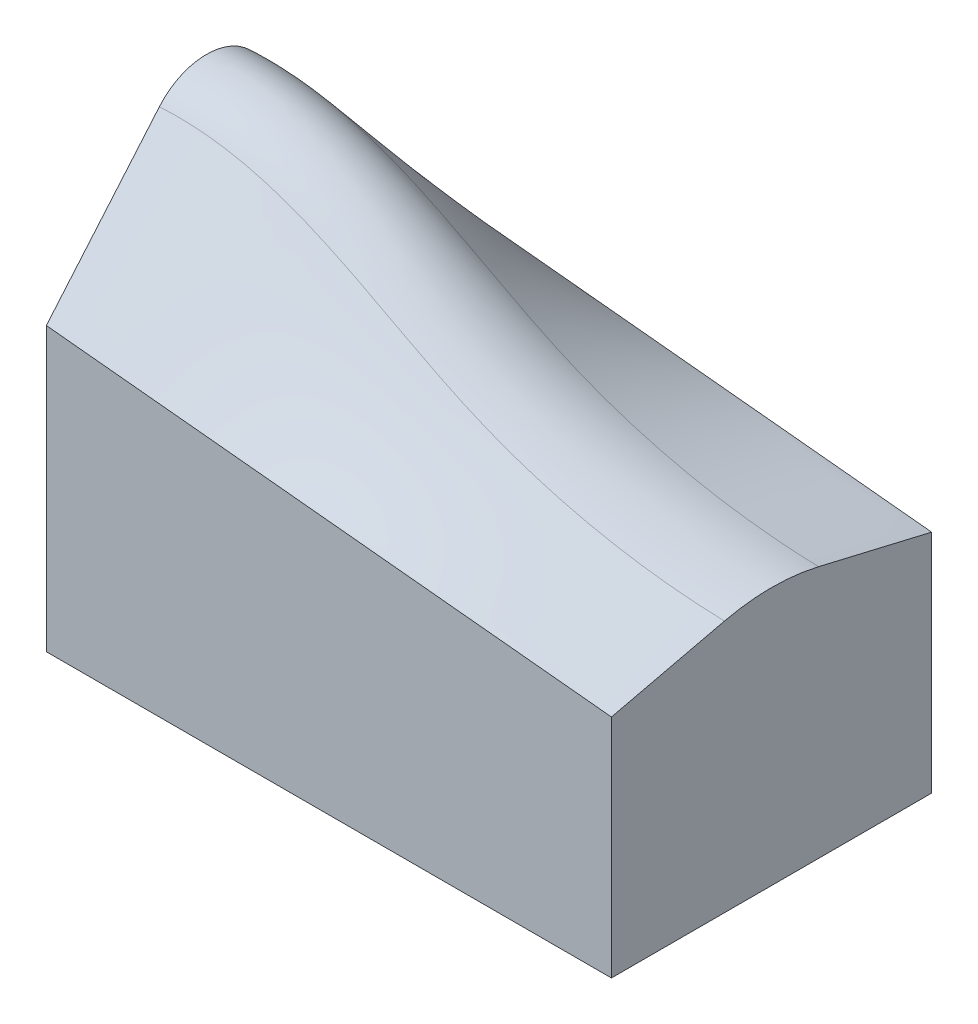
ISO-10303-21;
HEADER;
FILE_DESCRIPTION(('STEP AP214'),'2;1');
FILE_NAME('part.step','',(''),(''),'','','');
FILE_SCHEMA(('AUTOMOTIVE_DESIGN { 1 0 10303 214 1 1 1 1 }'));
ENDSEC;
DATA;
#1=APPLICATION_CONTEXT('core data for automotive mechanical design processes');
#2=APPLICATION_PROTOCOL_DEFINITION('international standard','automotive_design',2000,#1);
#3=PRODUCT_CONTEXT('',#1,'mechanical');
#4=PRODUCT('Part','Part','',(#3));
#5=PRODUCT_RELATED_PRODUCT_CATEGORY('part','',(#4));
#6=PRODUCT_DEFINITION_FORMATION('','',#4);
#7=PRODUCT_DEFINITION_CONTEXT('part definition',#1,'design');
#8=PRODUCT_DEFINITION('design','',#6,#7);
#9=PRODUCT_DEFINITION_SHAPE('','',#8);
#10=(LENGTH_UNIT() NAMED_UNIT(*) SI_UNIT(.MILLI.,.METRE.));
#11=(NAMED_UNIT(*) PLANE_ANGLE_UNIT() SI_UNIT($,.RADIAN.));
#12=(NAMED_UNIT(*) SI_UNIT($,.STERADIAN.) SOLID_ANGLE_UNIT());
#13=UNCERTAINTY_MEASURE_WITH_UNIT(LENGTH_MEASURE(1.E-05),#10,'distance_accuracy_value','');
#14=(GEOMETRIC_REPRESENTATION_CONTEXT(3) GLOBAL_UNCERTAINTY_ASSIGNED_CONTEXT((#13)) GLOBAL_UNIT_ASSIGNED_CONTEXT((#10,
#11,#12)) REPRESENTATION_CONTEXT('',''));
#15=CARTESIAN_POINT('',(0.,0.,0.));
#16=DIRECTION('',(0.,0.,1.));
#17=DIRECTION('',(1.,0.,0.));
#18=AXIS2_PLACEMENT_3D('',#15,#16,#17);
#19=CARTESIAN_POINT('',(3.16358629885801,7.32596468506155,2.50000000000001));
#20=CARTESIAN_POINT('',(2.63634932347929,7.34026394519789,2.50000000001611));
#21=CARTESIAN_POINT('',(2.10909878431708,7.35456357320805,2.50000000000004));
#22=CARTESIAN_POINT('',(1.31820231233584,7.37601357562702,2.50000000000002));
#23=CARTESIAN_POINT('',(1.05456671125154,7.38316366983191,2.50000000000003));
#24=CARTESIAN_POINT('',(0.659108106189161,7.39388895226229,2.50000000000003));
#25=CARTESIAN_POINT('',(0.527287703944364,7.39746406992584,2.50000000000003));
#26=CARTESIAN_POINT('',(0.263645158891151,7.40461435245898,2.50000000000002));
#27=CARTESIAN_POINT('',(0.131823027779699,7.40818947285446,2.50000018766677));
#28=CARTESIAN_POINT('',(-0.164778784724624,7.41623374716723,2.49999976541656));
#29=CARTESIAN_POINT('',(-0.289547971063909,7.42042110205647,2.49999999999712));
#30=CARTESIAN_POINT('',(-0.57800217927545,7.43143505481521,2.50000000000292));
#31=CARTESIAN_POINT('',(-0.72200883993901,7.43772946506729,2.49999999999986));
#32=CARTESIAN_POINT('',(-1.15339398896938,7.45895841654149,2.50000000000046));
#33=CARTESIAN_POINT('',(-1.4401375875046,7.47623749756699,2.49999999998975));
#34=CARTESIAN_POINT('',(-2.29804392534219,7.5373645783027,2.50000000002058));
#35=CARTESIAN_POINT('',(-2.86688276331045,7.59048407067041,2.50000000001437));
#36=CARTESIAN_POINT('',(-4.5658331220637,7.78690213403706,2.49999999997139));
#37=CARTESIAN_POINT('',(-5.68843891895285,7.96695883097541,2.50000000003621));
#38=CARTESIAN_POINT('',(-7.922081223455,8.4321767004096,2.49999999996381));
#39=CARTESIAN_POINT('',(-9.03819871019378,8.7189642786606,2.50000000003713));
#40=CARTESIAN_POINT('',(-11.2378363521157,9.40598581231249,2.49999999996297));
#41=CARTESIAN_POINT('',(-12.3193114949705,9.80496227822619,2.50000000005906));
#42=CARTESIAN_POINT('',(-14.4444547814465,10.7305007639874,2.49999999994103));
#43=CARTESIAN_POINT('',(-15.5453785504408,11.28619009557,2.49999999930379));
#44=CARTESIAN_POINT('',(-17.9244576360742,12.5421425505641,2.50000000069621));
#45=CARTESIAN_POINT('',(-19.1963021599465,13.2411888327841,2.49999999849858));
#46=CARTESIAN_POINT('',(-21.9403008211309,14.5553199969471,2.50000000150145));
#47=CARTESIAN_POINT('',(-23.4083820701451,15.1626577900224,2.49999999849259));
#48=CARTESIAN_POINT('',(-25.7844350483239,15.7704303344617,2.50000000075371));
#49=CARTESIAN_POINT('',(-26.6046193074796,15.9218251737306,2.49999999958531));
#50=CARTESIAN_POINT('',(-27.8687220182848,16.0493421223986,2.50000000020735));
#51=CARTESIAN_POINT('',(-28.295378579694,16.0752174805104,2.50000000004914));
#52=CARTESIAN_POINT('',(-28.9344923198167,16.0881115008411,2.49999999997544));
#53=CARTESIAN_POINT('',(-29.147674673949,16.0881379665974,2.50000000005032));
#54=CARTESIAN_POINT('',(-29.5739723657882,16.0797574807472,2.49999999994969));
#55=CARTESIAN_POINT('',(-29.787087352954,16.0713484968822,2.50000207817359));
#56=CARTESIAN_POINT('',(-30.0851650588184,16.0538135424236,2.49999916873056));
#57=CARTESIAN_POINT('',(-30.1410391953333,16.0505250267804,2.5));
#58=CARTESIAN_POINT('',(-30.2719385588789,16.0428231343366,2.49999999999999));
#59=CARTESIAN_POINT('',(-30.3373886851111,16.0389721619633,2.50000000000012));
#60=CARTESIAN_POINT('',(-30.5337404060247,16.0274191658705,2.49999999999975));
#61=CARTESIAN_POINT('',(-30.6646433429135,16.019717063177,2.49999999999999));
#62=CARTESIAN_POINT('',(-31.057357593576,15.9966104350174,2.5));
#63=CARTESIAN_POINT('',(-31.3191743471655,15.9812055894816,2.50000000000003));
#64=CARTESIAN_POINT('',(-32.104646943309,15.9349897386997,2.49999999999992));
#65=CARTESIAN_POINT('',(-32.6283251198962,15.904177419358,2.49999999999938));
#66=CARTESIAN_POINT('',(-33.1520346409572,15.8733632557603,2.5));
#67=CARTESIAN_POINT('',(3.18200019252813,8.00491489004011,0.));
#68=CARTESIAN_POINT('',(2.65516144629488,8.00402509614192,1.62099153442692E-12));
#69=CARTESIAN_POINT('',(2.12745369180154,8.00313383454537,-4.90650107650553E-12));
#70=CARTESIAN_POINT('',(1.33536506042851,8.00179605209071,2.45540287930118E-12));
#71=CARTESIAN_POINT('',(1.0715176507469,8.00135043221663,-1.130512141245E-13));
#72=CARTESIAN_POINT('',(0.675611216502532,8.00068177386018,0.));
#73=CARTESIAN_POINT('',(0.543687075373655,8.00045896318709,-5.76179924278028E-13));
#74=CARTESIAN_POINT('',(0.279838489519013,8.00001334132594,6.49916871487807E-13));
#75=CARTESIAN_POINT('',(0.14692625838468,7.99984294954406,-6.53441255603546E-13));
#76=CARTESIAN_POINT('',(-0.147663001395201,7.99922376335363,8.22027194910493E-13));
#77=CARTESIAN_POINT('',(-0.269493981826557,7.99992777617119,-9.92497481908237E-13));
#78=CARTESIAN_POINT('',(-0.553994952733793,8.00351409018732,1.03652081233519E-12));
#79=CARTESIAN_POINT('',(-0.696065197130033,8.00637822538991,-2.86546664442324E-12));
#80=CARTESIAN_POINT('',(-1.1215707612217,8.01815703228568,5.87465694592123E-12));
#81=CARTESIAN_POINT('',(-1.40461502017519,8.03025992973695,5.2402836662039E-12));
#82=CARTESIAN_POINT('',(-2.25099341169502,8.07914720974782,-1.03834145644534E-11));
#83=CARTESIAN_POINT('',(-2.8127766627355,8.12854386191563,-6.76389649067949E-12));
#84=CARTESIAN_POINT('',(-4.48765194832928,8.3265214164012,1.37909470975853E-11));
#85=CARTESIAN_POINT('',(-5.59533994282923,8.52555028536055,-4.02918768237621E-12));
#86=CARTESIAN_POINT('',(-7.77632068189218,9.05984099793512,4.17393113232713E-12));
#87=CARTESIAN_POINT('',(-8.86347040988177,9.40070821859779,-3.34946602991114E-12));
#88=CARTESIAN_POINT('',(-10.9660522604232,10.220830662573,3.47593008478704E-12));
#89=CARTESIAN_POINT('',(-11.9919729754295,10.7070031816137,-1.56771809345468E-11));
#90=CARTESIAN_POINT('',(-13.9473990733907,11.817960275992,1.63346640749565E-11));
#91=CARTESIAN_POINT('',(-14.9644618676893,12.5142394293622,-3.66992430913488E-12));
#92=CARTESIAN_POINT('',(-17.1366937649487,14.108921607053,3.99698022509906E-12));
#93=CARTESIAN_POINT('',(-18.324189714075,15.0395215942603,4.605241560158E-12));
#94=CARTESIAN_POINT('',(-21.0145718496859,16.8768496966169,-5.02673958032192E-12));
#95=CARTESIAN_POINT('',(-22.5281734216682,17.7624865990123,1.09952462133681E-12));
#96=CARTESIAN_POINT('',(-25.1927855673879,18.6701338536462,-5.5977800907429E-13));
#97=CARTESIAN_POINT('',(-26.1459666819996,18.8919995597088,3.83636727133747E-12));
#98=CARTESIAN_POINT('',(-27.6461920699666,19.0576701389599,-1.90468925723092E-12));
#99=CARTESIAN_POINT('',(-28.1532673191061,19.0841273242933,0.));
#100=CARTESIAN_POINT('',(-28.9138717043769,19.0802212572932,0.));
#101=CARTESIAN_POINT('',(-29.1666347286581,19.0717672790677,7.52830725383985E-13));
#102=CARTESIAN_POINT('',(-29.6708431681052,19.0409856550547,-7.34161546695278E-13));
#103=CARTESIAN_POINT('',(-29.9408267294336,19.016498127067,2.47052000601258E-13));
#104=CARTESIAN_POINT('',(-30.2647769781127,18.9792330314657,-1.00286589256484E-13));
#105=CARTESIAN_POINT('',(-30.3129876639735,18.9737207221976,1.77212893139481E-13));
#106=CARTESIAN_POINT('',(-30.443459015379,18.9587432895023,-1.90825716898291E-13));
#107=CARTESIAN_POINT('',(-30.5086950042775,18.9512545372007,2.52811213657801E-13));
#108=CARTESIAN_POINT('',(-30.7042639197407,18.9288042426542,-5.11027163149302E-13));
#109=CARTESIAN_POINT('',(-30.8347380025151,18.9138264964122,0.));
#110=CARTESIAN_POINT('',(-31.2256058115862,18.8689569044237,1.66773434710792E-13));
#111=CARTESIAN_POINT('',(-31.4865603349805,18.8390006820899,2.27576347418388E-13));
#112=CARTESIAN_POINT('',(-32.2672204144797,18.7493849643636,-4.49934374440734E-13));
#113=CARTESIAN_POINT('',(-32.7891394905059,18.6894713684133,-7.74812151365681E-12));
#114=CARTESIAN_POINT('',(-33.3141832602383,18.6291990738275,0.));
#115=CARTESIAN_POINT('',(3.163586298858,7.32596468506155,-2.49999999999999));
#116=CARTESIAN_POINT('',(2.6363493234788,7.3402639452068,-2.49999999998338));
#117=CARTESIAN_POINT('',(2.10909878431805,7.35456357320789,-2.50000000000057));
#118=CARTESIAN_POINT('',(1.31820231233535,7.37601357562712,-2.49999999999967));
#119=CARTESIAN_POINT('',(1.05456671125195,7.38316366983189,-2.50000000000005));
#120=CARTESIAN_POINT('',(0.659108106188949,7.39388895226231,-2.49999999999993));
#121=CARTESIAN_POINT('',(0.527287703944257,7.3974640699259,-2.49999999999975));
#122=CARTESIAN_POINT('',(0.263645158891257,7.40461435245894,-2.50000000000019));
#123=CARTESIAN_POINT('',(0.131823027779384,7.40818947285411,-2.50000018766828));
#124=CARTESIAN_POINT('',(-0.164778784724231,7.41623374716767,-2.49999976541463));
#125=CARTESIAN_POINT('',(-0.28954797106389,7.42042110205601,-2.49999999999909));
#126=CARTESIAN_POINT('',(-0.578002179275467,7.43143505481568,-2.50000000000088));
#127=CARTESIAN_POINT('',(-0.722008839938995,7.43772946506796,-2.49999999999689));
#128=CARTESIAN_POINT('',(-1.1533939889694,7.45895841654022,-2.50000000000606));
#129=CARTESIAN_POINT('',(-1.44013758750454,7.47623749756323,-2.50000000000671));
#130=CARTESIAN_POINT('',(-2.29804392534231,7.53736457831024,-2.49999999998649));
#131=CARTESIAN_POINT('',(-2.86688276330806,7.59048407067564,-2.49999999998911));
#132=CARTESIAN_POINT('',(-4.56583312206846,7.78690213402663,-2.50000000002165));
#133=CARTESIAN_POINT('',(-5.68843891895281,7.96695883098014,-2.50000000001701));
#134=CARTESIAN_POINT('',(-7.92208122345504,8.43217670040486,-2.49999999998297));
#135=CARTESIAN_POINT('',(-9.03819871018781,8.71896427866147,-2.50000000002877));
#136=CARTESIAN_POINT('',(-11.2378363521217,9.40598581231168,-2.49999999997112));
#137=CARTESIAN_POINT('',(-12.3193114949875,9.8049622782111,-2.500000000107));
#138=CARTESIAN_POINT('',(-14.4444547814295,10.7305007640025,-2.49999999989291));
#139=CARTESIAN_POINT('',(-15.5453785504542,11.2861900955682,-2.49999999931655));
#140=CARTESIAN_POINT('',(-17.9244576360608,12.542142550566,-2.50000000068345));
#141=CARTESIAN_POINT('',(-19.1963021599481,13.2411888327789,-2.49999999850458));
#142=CARTESIAN_POINT('',(-21.9403008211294,14.5553199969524,-2.50000000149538));
#143=CARTESIAN_POINT('',(-23.4083820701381,15.1626577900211,-2.49999999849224));
#144=CARTESIAN_POINT('',(-25.7844350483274,15.7704303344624,-2.50000000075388));
#145=CARTESIAN_POINT('',(-26.604619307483,15.9218251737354,-2.49999999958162));
#146=CARTESIAN_POINT('',(-27.8687220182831,16.0493421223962,-2.50000000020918));
#147=CARTESIAN_POINT('',(-28.2953785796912,16.0752174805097,-2.50000000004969));
#148=CARTESIAN_POINT('',(-28.9344923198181,16.0881115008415,-2.49999999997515));
#149=CARTESIAN_POINT('',(-29.1476746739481,16.0881379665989,-2.50000000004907));
#150=CARTESIAN_POINT('',(-29.5739723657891,16.0797574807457,-2.49999999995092));
#151=CARTESIAN_POINT('',(-29.787087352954,16.0713484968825,-2.5000020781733));
#152=CARTESIAN_POINT('',(-30.0851650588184,16.0538135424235,-2.49999916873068));
#153=CARTESIAN_POINT('',(-30.1410391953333,16.0505250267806,-2.49999999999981));
#154=CARTESIAN_POINT('',(-30.2719385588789,16.0428231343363,-2.5000000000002));
#155=CARTESIAN_POINT('',(-30.3373886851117,16.0389721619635,-2.49999999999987));
#156=CARTESIAN_POINT('',(-30.5337404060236,16.02741916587,-2.50000000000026));
#157=CARTESIAN_POINT('',(-30.6646433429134,16.019717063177,-2.5));
#158=CARTESIAN_POINT('',(-31.057357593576,15.9966104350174,-2.50000000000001));
#159=CARTESIAN_POINT('',(-31.3191743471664,15.9812055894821,-2.49999999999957));
#160=CARTESIAN_POINT('',(-32.1046469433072,15.9349897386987,-2.50000000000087));
#161=CARTESIAN_POINT('',(-32.6283251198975,15.9041774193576,-2.49999999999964));
#162=CARTESIAN_POINT('',(-33.1520346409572,15.8733632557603,-2.5));
#163=(BOUNDED_SURFACE() B_SPLINE_SURFACE(2,3,((#19,#20,#21,#22,#23,#24,#25,#26,#27,#28,#29,#30,
#31,#32,#33,#34,#35,#36,#37,#38,#39,#40,#41,#42,#43,#44,#45,#46,#47,#48,#49,#50,#51,#52,#53,#54,
#55,#56,#57,#58,#59,#60,#61,#62,#63,#64,#65,#66),(#67,#68,#69,#70,#71,#72,#73,#74,#75,#76,#77,
#78,#79,#80,#81,#82,#83,#84,#85,#86,#87,#88,#89,#90,#91,#92,#93,#94,#95,#96,#97,#98,#99,#100,
#101,#102,#103,#104,#105,#106,#107,#108,#109,#110,#111,#112,#113,#114),(#115,#116,#117,#118,
#119,#120,#121,#122,#123,#124,#125,#126,#127,#128,#129,#130,#131,#132,#133,#134,#135,#136,#137,
#138,#139,#140,#141,#142,#143,#144,#145,#146,#147,#148,#149,#150,#151,#152,#153,#154,#155,#156,
#157,#158,#159,#160,#161,#162)),.UNSPECIFIED.,.F.,.F.,.F.) B_SPLINE_SURFACE_WITH_KNOTS((3,3),(4,
2,2,2,2,2,2,2,2,2,2,2,2,2,2,2,2,2,2,2,2,2,2,4),(0.,1.),(0.00714343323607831,0.00872139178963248,
0.00951037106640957,0.00990486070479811,0.0102993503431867,0.0107924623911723,0.011285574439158,
0.0122717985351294,0.0142442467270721,0.0181891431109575,0.0221340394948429,0.0260789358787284,
0.0300238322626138,0.0339687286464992,0.0379136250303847,0.0398860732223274,0.0408722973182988,
0.0413654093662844,0.0418585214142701,0.0420557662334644,0.0422530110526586,0.0426475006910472,
0.0434364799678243,0.0450144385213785),
.UNSPECIFIED.) GEOMETRIC_REPRESENTATION_ITEM() RATIONAL_B_SPLINE_SURFACE(((1.,1.,1.,1.,1.,1.,1.,
1.,1.,1.,1.,1.,1.,1.,1.,1.,1.,1.,1.,1.,1.,1.,1.,1.,1.,1.,1.,1.,1.,1.,1.,1.,1.,1.,1.,1.,1.,1.,1.,
1.,1.,1.,1.,1.,1.,1.,1.,1.),(0.965019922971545,0.96650399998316,0.967948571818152,
0.970053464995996,0.970744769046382,0.971765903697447,0.972103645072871,0.972773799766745,
0.973103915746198,0.973850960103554,0.974141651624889,0.974761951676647,0.975044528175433,
0.975813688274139,0.976221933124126,0.977157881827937,0.97740034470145,0.977051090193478,
0.975436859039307,0.968473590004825,0.963069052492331,0.946133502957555,0.934574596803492,
0.902884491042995,0.880279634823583,0.820057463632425,0.782255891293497,0.709071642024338,
0.674653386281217,0.645825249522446,0.64003282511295,0.6382399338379,0.638781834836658,
0.641203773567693,0.642277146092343,0.644923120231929,0.64663836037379,0.648961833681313,
0.649303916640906,0.650239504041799,0.650707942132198,0.652115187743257,0.653055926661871,
0.655885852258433,0.65778274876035,0.66350410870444,0.667359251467,0.671254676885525),(1.,1.,1.,
1.,1.,1.,1.,1.,1.,1.,1.,1.,1.,1.,1.,1.,1.,1.,1.,1.,1.,1.,1.,1.,1.,1.,1.,1.,1.,1.,1.,1.,1.,1.,1.,
1.,1.,1.,1.,1.,1.,1.,1.,1.,1.,1.,1.,1.))) REPRESENTATION_ITEM('') SURFACE());
#164=CARTESIAN_POINT('',(0.,7.41176470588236,2.50000000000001));
#165=CARTESIAN_POINT('',(-4.5771550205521,7.53590230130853,2.50000000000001));
#166=CARTESIAN_POINT('',(-15.3083363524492,9.67056029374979,2.50000000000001));
#167=CARTESIAN_POINT('',(-23.2907730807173,16.4535828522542,2.50000000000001));
#168=CARTESIAN_POINT('',(-30.,16.0588235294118,2.50000000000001));
#169=B_SPLINE_CURVE_WITH_KNOTS('',3,(#164,#165,#166,#167,#168),.UNSPECIFIED.,.F.,.F.,(4,1,4),
(0.,0.43459880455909,1.),.UNSPECIFIED.);
#170=CARTESIAN_POINT('',(0.,7.41176470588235,2.50000000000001));
#171=VERTEX_POINT('',#170);
#172=CARTESIAN_POINT('',(-30.,16.0588235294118,2.5));
#173=VERTEX_POINT('',#172);
#174=EDGE_CURVE('E342',#171,#173,#169,.T.);
#175=CARTESIAN_POINT('',(0.,7.41176470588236,-2.49999999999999));
#176=CARTESIAN_POINT('',(-9.1337761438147E-13,7.47403317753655,-2.2354375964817));
#177=CARTESIAN_POINT('',(-5.65686585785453E-13,7.52636948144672,-1.96854600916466));
#178=CARTESIAN_POINT('',(5.65668704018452E-13,7.6109888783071,-1.4316106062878));
#179=CARTESIAN_POINT('',(1.34931918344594E-12,7.64327260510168,-1.1615668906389));
#180=CARTESIAN_POINT('',(1.26523274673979E-12,7.68835391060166,-0.610626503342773));
#181=CARTESIAN_POINT('',(3.40567396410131E-13,7.70045322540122,-0.329672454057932));
#182=CARTESIAN_POINT('',(-3.40577192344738E-13,7.70295795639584,0.232337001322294));
#183=CARTESIAN_POINT('',(0.,7.6933627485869,0.513392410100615));
#184=CARTESIAN_POINT('',(1.02463174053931E-13,7.6520131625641,1.08088725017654));
#185=CARTESIAN_POINT('',(0.,7.61971477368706,1.36728720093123));
#186=CARTESIAN_POINT('',(0.,7.53258687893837,1.93666610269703));
#187=CARTESIAN_POINT('',(-1.01974186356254E-13,7.47775524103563,2.21964472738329));
#188=CARTESIAN_POINT('',(0.,7.41176470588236,2.50000000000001));
#189=B_SPLINE_CURVE_WITH_KNOTS('',3,(#175,#176,#177,#178,#179,#180,#181,#182,#183,#184,#185,
#186,#187,#188),.UNSPECIFIED.,.F.,.F.,(4,2,2,2,2,2,4),(0.,0.815171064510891,1.63031636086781,
2.47311699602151,3.31594187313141,4.1796829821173,5.04350583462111),.UNSPECIFIED.);
#190=CARTESIAN_POINT('',(0.,7.41176470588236,-2.49999999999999));
#191=VERTEX_POINT('',#190);
#192=EDGE_CURVE('E121',#191,#171,#189,.T.);
#193=CARTESIAN_POINT('',(-30.,16.0588235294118,-2.5));
#194=CARTESIAN_POINT('',(-23.2907730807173,16.4535828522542,-2.5));
#195=CARTESIAN_POINT('',(-15.3083363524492,9.67056029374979,-2.5));
#196=CARTESIAN_POINT('',(-4.57715502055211,7.53590230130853,-2.5));
#197=CARTESIAN_POINT('',(0.,7.41176470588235,-2.5));
#198=B_SPLINE_CURVE_WITH_KNOTS('',3,(#193,#194,#195,#196,#197),.UNSPECIFIED.,.F.,.F.,(4,1,4),
(0.,0.56540119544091,1.),.UNSPECIFIED.);
#199=CARTESIAN_POINT('',(-30.,16.0588235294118,-2.5));
#200=VERTEX_POINT('',#199);
#201=EDGE_CURVE('E353',#200,#191,#198,.T.);
#202=CARTESIAN_POINT('',(-30.,16.0588235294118,2.5));
#203=CARTESIAN_POINT('',(-30.,16.1292522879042,2.44014721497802));
#204=CARTESIAN_POINT('',(-30.,16.1971496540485,2.37732158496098));
#205=CARTESIAN_POINT('',(-30.,16.327425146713,2.24619059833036));
#206=CARTESIAN_POINT('',(-30.,16.3898034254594,2.17788539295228));
#207=CARTESIAN_POINT('',(-30.,16.5085537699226,2.03629894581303));
#208=CARTESIAN_POINT('',(-30.,16.5649292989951,1.96302061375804));
#209=CARTESIAN_POINT('',(-30.,16.6712996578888,1.81200216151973));
#210=CARTESIAN_POINT('',(-30.,16.7212946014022,1.73426212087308));
#211=CARTESIAN_POINT('',(-30.,16.861196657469,1.49504911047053));
#212=CARTESIAN_POINT('',(-30.,16.9410604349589,1.32753615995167));
#213=CARTESIAN_POINT('',(-30.,17.0713849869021,0.981582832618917));
#214=CARTESIAN_POINT('',(-30.,17.1218525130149,0.803144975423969));
#215=CARTESIAN_POINT('',(-30.,17.191935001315,0.440725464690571));
#216=CARTESIAN_POINT('',(-30.,17.2116229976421,0.256757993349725));
#217=CARTESIAN_POINT('',(-30.,17.2197840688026,-0.11187336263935));
#218=CARTESIAN_POINT('',(-30.,17.2082554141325,-0.296537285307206));
#219=CARTESIAN_POINT('',(-30.,17.154366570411,-0.660999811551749));
#220=CARTESIAN_POINT('',(-30.,17.112056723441,-0.840805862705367));
#221=CARTESIAN_POINT('',(-30.,16.9978509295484,-1.19085576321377));
#222=CARTESIAN_POINT('',(-30.,16.9259420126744,-1.36109538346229));
#223=CARTESIAN_POINT('',(-30.,16.7544908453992,-1.68739202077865));
#224=CARTESIAN_POINT('',(-30.,16.6548994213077,-1.84342313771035));
#225=CARTESIAN_POINT('',(-30.,16.4311288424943,-2.13633758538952));
#226=CARTESIAN_POINT('',(-30.,16.3070036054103,-2.27326180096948));
#227=CARTESIAN_POINT('',(-30.,16.1353932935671,-2.43338448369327));
#228=CARTESIAN_POINT('',(-30.,16.0974821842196,-2.46714966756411));
#229=CARTESIAN_POINT('',(-30.,16.0588235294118,-2.5));
#230=B_SPLINE_CURVE_WITH_KNOTS('',3,(#202,#203,#204,#205,#206,#207,#208,#209,#210,#211,#212,
#213,#214,#215,#216,#217,#218,#219,#220,#221,#222,#223,#224,#225,#226,#227,#228,#229),
.UNSPECIFIED.,.F.,.F.,(4,2,2,2,2,2,2,2,2,2,2,2,2,4),(0.,0.277189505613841,0.554371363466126,
0.831392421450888,1.10840854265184,1.66225883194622,2.21598186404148,2.76838900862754,
3.32082675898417,3.87236303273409,4.42414124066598,4.97690593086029,5.52846906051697,
5.68071133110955),.UNSPECIFIED.);
#231=EDGE_CURVE('E13',#173,#200,#230,.T.);
#232=ORIENTED_EDGE('',*,*,#174,.F.);
#233=ORIENTED_EDGE('',*,*,#192,.F.);
#234=ORIENTED_EDGE('',*,*,#201,.F.);
#235=ORIENTED_EDGE('',*,*,#231,.F.);
#236=EDGE_LOOP('',(#232,#233,#234,#235));
#237=FACE_BOUND('',#236,.T.);
#238=ADVANCED_FACE('F108',(#237),#163,.T.);
#239=CARTESIAN_POINT('',(-30.,0.,0.));
#240=DIRECTION('',(1.,0.,0.));
#241=DIRECTION('',(0.,0.,-1.));
#242=AXIS2_PLACEMENT_3D('',#239,#240,#241);
#243=PLANE('',#242);
#244=DIRECTION('',(0.,-0.761939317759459,0.64764842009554));
#245=VECTOR('',#244,1.);
#246=CARTESIAN_POINT('',(-30.,9.,8.5));
#247=LINE('',#246,#245);
#248=CARTESIAN_POINT('',(-30.,9.,8.5));
#249=VERTEX_POINT('',#248);
#250=EDGE_CURVE('E382',#173,#249,#247,.T.);
#251=ORIENTED_EDGE('',*,*,#250,.F.);
#252=ORIENTED_EDGE('',*,*,#231,.T.);
#253=DIRECTION('',(0.,0.761939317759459,0.647648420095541));
#254=VECTOR('',#253,1.);
#255=CARTESIAN_POINT('',(-30.,19.,0.));
#256=LINE('',#255,#254);
#257=CARTESIAN_POINT('',(-30.,9.,-8.5));
#258=VERTEX_POINT('',#257);
#259=EDGE_CURVE('E281',#258,#200,#256,.T.);
#260=ORIENTED_EDGE('',*,*,#259,.F.);
#261=DIRECTION('',(0.,1.,0.));
#262=VECTOR('',#261,1.);
#263=CARTESIAN_POINT('',(-30.,-6.,-8.5));
#264=LINE('',#263,#262);
#265=CARTESIAN_POINT('',(-30.,-6.,-8.5));
#266=VERTEX_POINT('',#265);
#267=EDGE_CURVE('E416',#266,#258,#264,.T.);
#268=ORIENTED_EDGE('',*,*,#267,.F.);
#269=DIRECTION('',(0.,0.,-1.));
#270=VECTOR('',#269,1.);
#271=CARTESIAN_POINT('',(-30.,-6.,8.5));
#272=LINE('',#271,#270);
#273=CARTESIAN_POINT('',(-30.,-6.,8.49999999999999));
#274=VERTEX_POINT('',#273);
#275=EDGE_CURVE('E200',#274,#266,#272,.T.);
#276=ORIENTED_EDGE('',*,*,#275,.F.);
#277=DIRECTION('',(0.,-1.,0.));
#278=VECTOR('',#277,1.);
#279=CARTESIAN_POINT('',(-30.,-6.,8.5));
#280=LINE('',#279,#278);
#281=EDGE_CURVE('E387',#249,#274,#280,.T.);
#282=ORIENTED_EDGE('',*,*,#281,.F.);
#283=EDGE_LOOP('',(#251,#252,#260,#268,#276,#282));
#284=FACE_BOUND('',#283,.T.);
#285=ADVANCED_FACE('F253',(#284),#243,.F.);
#286=CARTESIAN_POINT('',(0.,0.,0.));
#287=DIRECTION('',(1.,0.,0.));
#288=DIRECTION('',(0.,0.,-1.));
#289=AXIS2_PLACEMENT_3D('',#286,#287,#288);
#290=PLANE('',#289);
#291=DIRECTION('',(0.,0.229039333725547,0.973417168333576));
#292=VECTOR('',#291,1.);
#293=CARTESIAN_POINT('',(0.,8.,0.));
#294=LINE('',#293,#292);
#295=CARTESIAN_POINT('',(0.,6.,-8.5));
#296=VERTEX_POINT('',#295);
#297=EDGE_CURVE('E194',#296,#191,#294,.T.);
#298=ORIENTED_EDGE('',*,*,#297,.T.);
#299=ORIENTED_EDGE('',*,*,#192,.T.);
#300=DIRECTION('',(0.,-0.229039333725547,0.973417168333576));
#301=VECTOR('',#300,1.);
#302=CARTESIAN_POINT('',(0.,6.,8.5));
#303=LINE('',#302,#301);
#304=CARTESIAN_POINT('',(0.,6.,8.5));
#305=VERTEX_POINT('',#304);
#306=EDGE_CURVE('E206',#171,#305,#303,.T.);
#307=ORIENTED_EDGE('',*,*,#306,.T.);
#308=DIRECTION('',(0.,-1.,0.));
#309=VECTOR('',#308,1.);
#310=CARTESIAN_POINT('',(0.,-6.,8.5));
#311=LINE('',#310,#309);
#312=CARTESIAN_POINT('',(0.,-6.,8.5));
#313=VERTEX_POINT('',#312);
#314=EDGE_CURVE('E175',#305,#313,#311,.T.);
#315=ORIENTED_EDGE('',*,*,#314,.T.);
#316=DIRECTION('',(0.,0.,-1.));
#317=VECTOR('',#316,1.);
#318=CARTESIAN_POINT('',(0.,-6.,8.5));
#319=LINE('',#318,#317);
#320=CARTESIAN_POINT('',(0.,-6.,-8.5));
#321=VERTEX_POINT('',#320);
#322=EDGE_CURVE('E166',#313,#321,#319,.T.);
#323=ORIENTED_EDGE('',*,*,#322,.T.);
#324=DIRECTION('',(0.,1.,0.));
#325=VECTOR('',#324,1.);
#326=CARTESIAN_POINT('',(0.,-6.,-8.5));
#327=LINE('',#326,#325);
#328=EDGE_CURVE('E171',#321,#296,#327,.T.);
#329=ORIENTED_EDGE('',*,*,#328,.T.);
#330=EDGE_LOOP('',(#298,#299,#307,#315,#323,#329));
#331=FACE_BOUND('',#330,.T.);
#332=ADVANCED_FACE('F170',(#331),#290,.T.);
#333=CARTESIAN_POINT('',(0.,6.,8.5));
#334=CARTESIAN_POINT('',(-4.3459880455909,6.43459880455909,8.5));
#335=CARTESIAN_POINT('',(-14.3459880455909,7.43459880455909,8.5));
#336=CARTESIAN_POINT('',(-24.3459880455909,8.43459880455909,8.5));
#337=CARTESIAN_POINT('',(-30.,9.,8.5));
#338=CARTESIAN_POINT('',(0.,6.16666666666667,7.79166666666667));
#339=CARTESIAN_POINT('',(-4.37327859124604,6.56461380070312,7.79166666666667));
#340=CARTESIAN_POINT('',(-14.459598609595,7.69856648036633,7.79166666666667));
#341=CARTESIAN_POINT('',(-24.2214140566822,9.38128442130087,7.79166666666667));
#342=CARTESIAN_POINT('',(-30.,9.83333333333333,7.79166666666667));
#343=CARTESIAN_POINT('',(0.,6.50000000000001,6.375));
#344=CARTESIAN_POINT('',(-4.42785968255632,6.8246437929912,6.375));
#345=CARTESIAN_POINT('',(-14.6868197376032,8.22650183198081,6.375));
#346=CARTESIAN_POINT('',(-23.9722660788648,11.2746556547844,6.37499999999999));
#347=CARTESIAN_POINT('',(-30.,11.5,6.37499999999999));
#348=CARTESIAN_POINT('',(0.,6.99999999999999,4.25000000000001));
#349=CARTESIAN_POINT('',(-4.50973131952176,7.21468878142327,4.25000000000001));
#350=CARTESIAN_POINT('',(-15.0276514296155,9.0184048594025,4.25000000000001));
#351=CARTESIAN_POINT('',(-23.5985441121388,14.1147125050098,4.25000000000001));
#352=CARTESIAN_POINT('',(-30.,14.,4.25000000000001));
#353=CARTESIAN_POINT('',(0.,7.50000000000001,2.12499999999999));
#354=CARTESIAN_POINT('',(-4.59160295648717,7.60473376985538,2.12499999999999));
#355=CARTESIAN_POINT('',(-15.3684831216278,9.81030788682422,2.12499999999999));
#356=CARTESIAN_POINT('',(-23.2248221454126,16.9547693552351,2.12499999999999));
#357=CARTESIAN_POINT('',(-30.,16.5,2.12499999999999));
#358=CARTESIAN_POINT('',(0.,7.83333333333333,0.708333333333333));
#359=CARTESIAN_POINT('',(-4.64618404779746,7.86476376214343,0.708333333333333));
#360=CARTESIAN_POINT('',(-15.5957042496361,10.3382432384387,0.708333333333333));
#361=CARTESIAN_POINT('',(-22.9756741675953,18.8481405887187,0.708333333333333));
#362=CARTESIAN_POINT('',(-30.,18.1666666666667,0.708333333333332));
#363=CARTESIAN_POINT('',(0.,8.,0.));
#364=CARTESIAN_POINT('',(-4.67347459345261,7.99477875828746,0.));
#365=CARTESIAN_POINT('',(-15.7093148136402,10.6022109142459,0.));
#366=CARTESIAN_POINT('',(-22.8511001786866,19.7948262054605,0.));
#367=CARTESIAN_POINT('',(-30.,19.,0.));
#368=B_SPLINE_SURFACE_WITH_KNOTS('',3,3,((#333,#334,#335,#336,#337),(#338,#339,#340,#341,#342),
(#343,#344,#345,#346,#347),(#348,#349,#350,#351,#352),(#353,#354,#355,#356,#357),(#358,#359,
#360,#361,#362),(#363,#364,#365,#366,#367)),.UNSPECIFIED.,.F.,.F.,.F.,(4,1,1,1,4),(4,1,4),
(0.835732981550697,0.876799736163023,0.917866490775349,0.958933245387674,1.),(0.,
0.43459880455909,1.),.UNSPECIFIED.);
#369=CARTESIAN_POINT('',(0.,6.,8.5));
#370=CARTESIAN_POINT('',(-4.3459880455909,6.43459880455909,8.5));
#371=CARTESIAN_POINT('',(-14.3459880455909,7.43459880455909,8.5));
#372=CARTESIAN_POINT('',(-24.3459880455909,8.43459880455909,8.5));
#373=CARTESIAN_POINT('',(-30.,9.,8.5));
#374=B_SPLINE_CURVE_WITH_KNOTS('',3,(#369,#370,#371,#372,#373),.UNSPECIFIED.,.F.,.F.,(4,1,4),
(0.,0.43459880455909,1.),.UNSPECIFIED.);
#375=EDGE_CURVE('E204',#305,#249,#374,.T.);
#376=ORIENTED_EDGE('',*,*,#306,.F.);
#377=ORIENTED_EDGE('',*,*,#174,.T.);
#378=ORIENTED_EDGE('',*,*,#250,.T.);
#379=ORIENTED_EDGE('',*,*,#375,.F.);
#380=EDGE_LOOP('',(#376,#377,#378,#379));
#381=FACE_BOUND('',#380,.T.);
#382=ADVANCED_FACE('F234',(#381),#368,.T.);
#383=CARTESIAN_POINT('',(0.,-6.,8.5));
#384=DIRECTION('',(0.,0.,1.));
#385=DIRECTION('',(0.,1.,0.));
#386=AXIS2_PLACEMENT_3D('',#383,#384,#385);
#387=PLANE('',#386);
#388=ORIENTED_EDGE('',*,*,#314,.F.);
#389=ORIENTED_EDGE('',*,*,#375,.T.);
#390=ORIENTED_EDGE('',*,*,#281,.T.);
#391=CARTESIAN_POINT('',(0.,-6.,8.5));
#392=CARTESIAN_POINT('',(-4.3459880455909,-6.,8.5));
#393=CARTESIAN_POINT('',(-14.3459880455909,-6.,8.5));
#394=CARTESIAN_POINT('',(-24.3459880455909,-6.,8.5));
#395=CARTESIAN_POINT('',(-30.,-6.,8.49999999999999));
#396=B_SPLINE_CURVE_WITH_KNOTS('',3,(#391,#392,#393,#394,#395),.UNSPECIFIED.,.F.,.F.,(4,1,4),
(0.,0.43459880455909,1.),.UNSPECIFIED.);
#397=EDGE_CURVE('E202',#313,#274,#396,.T.);
#398=ORIENTED_EDGE('',*,*,#397,.F.);
#399=EDGE_LOOP('',(#388,#389,#390,#398));
#400=FACE_BOUND('',#399,.T.);
#401=ADVANCED_FACE('F246',(#400),#387,.T.);
#402=CARTESIAN_POINT('',(0.,-6.,-8.5));
#403=DIRECTION('',(0.,-1.,0.));
#404=DIRECTION('',(0.,0.,1.));
#405=AXIS2_PLACEMENT_3D('',#402,#403,#404);
#406=PLANE('',#405);
#407=ORIENTED_EDGE('',*,*,#322,.F.);
#408=ORIENTED_EDGE('',*,*,#397,.T.);
#409=ORIENTED_EDGE('',*,*,#275,.T.);
#410=CARTESIAN_POINT('',(0.,-6.,-8.5));
#411=CARTESIAN_POINT('',(-4.3459880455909,-6.,-8.5));
#412=CARTESIAN_POINT('',(-14.3459880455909,-6.,-8.5));
#413=CARTESIAN_POINT('',(-24.3459880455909,-6.,-8.5));
#414=CARTESIAN_POINT('',(-30.,-6.,-8.5));
#415=B_SPLINE_CURVE_WITH_KNOTS('',3,(#410,#411,#412,#413,#414),.UNSPECIFIED.,.F.,.F.,(4,1,4),
(0.,0.43459880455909,1.),.UNSPECIFIED.);
#416=EDGE_CURVE('E190',#321,#266,#415,.T.);
#417=ORIENTED_EDGE('',*,*,#416,.F.);
#418=EDGE_LOOP('',(#407,#408,#409,#417));
#419=FACE_BOUND('',#418,.T.);
#420=ADVANCED_FACE('F198',(#419),#406,.T.);
#421=CARTESIAN_POINT('',(0.,6.,-8.5));
#422=DIRECTION('',(0.,0.,-1.));
#423=DIRECTION('',(0.,-1.,0.));
#424=AXIS2_PLACEMENT_3D('',#421,#422,#423);
#425=PLANE('',#424);
#426=ORIENTED_EDGE('',*,*,#328,.F.);
#427=ORIENTED_EDGE('',*,*,#416,.T.);
#428=ORIENTED_EDGE('',*,*,#267,.T.);
#429=CARTESIAN_POINT('',(0.,6.,-8.5));
#430=CARTESIAN_POINT('',(-4.3459880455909,6.43459880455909,-8.5));
#431=CARTESIAN_POINT('',(-14.3459880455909,7.43459880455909,-8.5));
#432=CARTESIAN_POINT('',(-24.3459880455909,8.43459880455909,-8.5));
#433=CARTESIAN_POINT('',(-30.,9.,-8.5));
#434=B_SPLINE_CURVE_WITH_KNOTS('',3,(#429,#430,#431,#432,#433),.UNSPECIFIED.,.F.,.F.,(4,1,4),
(0.,0.43459880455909,1.),.UNSPECIFIED.);
#435=EDGE_CURVE('E193',#296,#258,#434,.T.);
#436=ORIENTED_EDGE('',*,*,#435,.F.);
#437=EDGE_LOOP('',(#426,#427,#428,#436));
#438=FACE_BOUND('',#437,.T.);
#439=ADVANCED_FACE('F189',(#438),#425,.T.);
#440=CARTESIAN_POINT('',(0.,8.,0.));
#441=CARTESIAN_POINT('',(-4.67347459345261,7.99477875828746,0.));
#442=CARTESIAN_POINT('',(-15.7093148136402,10.6022109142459,0.));
#443=CARTESIAN_POINT('',(-22.8511001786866,19.7948262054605,0.));
#444=CARTESIAN_POINT('',(-30.,19.,0.));
#445=CARTESIAN_POINT('',(0.,7.83333333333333,-0.708333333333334));
#446=CARTESIAN_POINT('',(-4.64618404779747,7.86476376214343,-0.708333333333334));
#447=CARTESIAN_POINT('',(-15.5957042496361,10.3382432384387,-0.708333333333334));
#448=CARTESIAN_POINT('',(-22.9756741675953,18.8481405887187,-0.708333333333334));
#449=CARTESIAN_POINT('',(-30.,18.1666666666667,-0.708333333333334));
#450=CARTESIAN_POINT('',(0.,7.5,-2.125));
#451=CARTESIAN_POINT('',(-4.59160295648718,7.60473376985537,-2.125));
#452=CARTESIAN_POINT('',(-15.3684831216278,9.81030788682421,-2.125));
#453=CARTESIAN_POINT('',(-23.2248221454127,16.9547693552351,-2.125));
#454=CARTESIAN_POINT('',(-30.,16.5,-2.125));
#455=CARTESIAN_POINT('',(0.,7.,-4.25000000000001));
#456=CARTESIAN_POINT('',(-4.50973131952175,7.21468878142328,-4.25000000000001));
#457=CARTESIAN_POINT('',(-15.0276514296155,9.01840485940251,-4.25000000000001));
#458=CARTESIAN_POINT('',(-23.5985441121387,14.1147125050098,-4.25000000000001));
#459=CARTESIAN_POINT('',(-30.,14.,-4.25000000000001));
#460=CARTESIAN_POINT('',(0.,6.5,-6.37499999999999));
#461=CARTESIAN_POINT('',(-4.42785968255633,6.82464379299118,-6.37499999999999));
#462=CARTESIAN_POINT('',(-14.6868197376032,8.22650183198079,-6.375));
#463=CARTESIAN_POINT('',(-23.9722660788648,11.2746556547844,-6.375));
#464=CARTESIAN_POINT('',(-30.,11.5,-6.375));
#465=CARTESIAN_POINT('',(0.,6.16666666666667,-7.79166666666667));
#466=CARTESIAN_POINT('',(-4.37327859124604,6.56461380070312,-7.79166666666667));
#467=CARTESIAN_POINT('',(-14.459598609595,7.69856648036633,-7.79166666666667));
#468=CARTESIAN_POINT('',(-24.2214140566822,9.38128442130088,-7.79166666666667));
#469=CARTESIAN_POINT('',(-30.,9.83333333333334,-7.79166666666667));
#470=CARTESIAN_POINT('',(0.,6.,-8.5));
#471=CARTESIAN_POINT('',(-4.3459880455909,6.43459880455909,-8.5));
#472=CARTESIAN_POINT('',(-14.3459880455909,7.43459880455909,-8.5));
#473=CARTESIAN_POINT('',(-24.3459880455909,8.43459880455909,-8.5));
#474=CARTESIAN_POINT('',(-30.,9.,-8.5));
#475=B_SPLINE_SURFACE_WITH_KNOTS('',3,3,((#440,#441,#442,#443,#444),(#445,#446,#447,#448,#449),
(#450,#451,#452,#453,#454),(#455,#456,#457,#458,#459),(#460,#461,#462,#463,#464),(#465,#466,
#467,#468,#469),(#470,#471,#472,#473,#474)),.UNSPECIFIED.,.F.,.F.,.F.,(4,1,1,1,4),(4,1,4),(0.,
0.0410667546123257,0.0821335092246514,0.123200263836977,0.164267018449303),(0.,0.43459880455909,
1.),.UNSPECIFIED.);
#476=ORIENTED_EDGE('',*,*,#259,.T.);
#477=ORIENTED_EDGE('',*,*,#201,.T.);
#478=ORIENTED_EDGE('',*,*,#297,.F.);
#479=ORIENTED_EDGE('',*,*,#435,.T.);
#480=EDGE_LOOP('',(#476,#477,#478,#479));
#481=FACE_BOUND('',#480,.T.);
#482=ADVANCED_FACE('F248',(#481),#475,.T.);
#483=CLOSED_SHELL('',(#238,#285,#332,#382,#401,#420,#439,#482));
#484=MANIFOLD_SOLID_BREP('B2',#483);
#485=ADVANCED_BREP_SHAPE_REPRESENTATION('',(#18,#484),#14);
#486=SHAPE_DEFINITION_REPRESENTATION(#9,#485);
ENDSEC;
END-ISO-10303-21;
